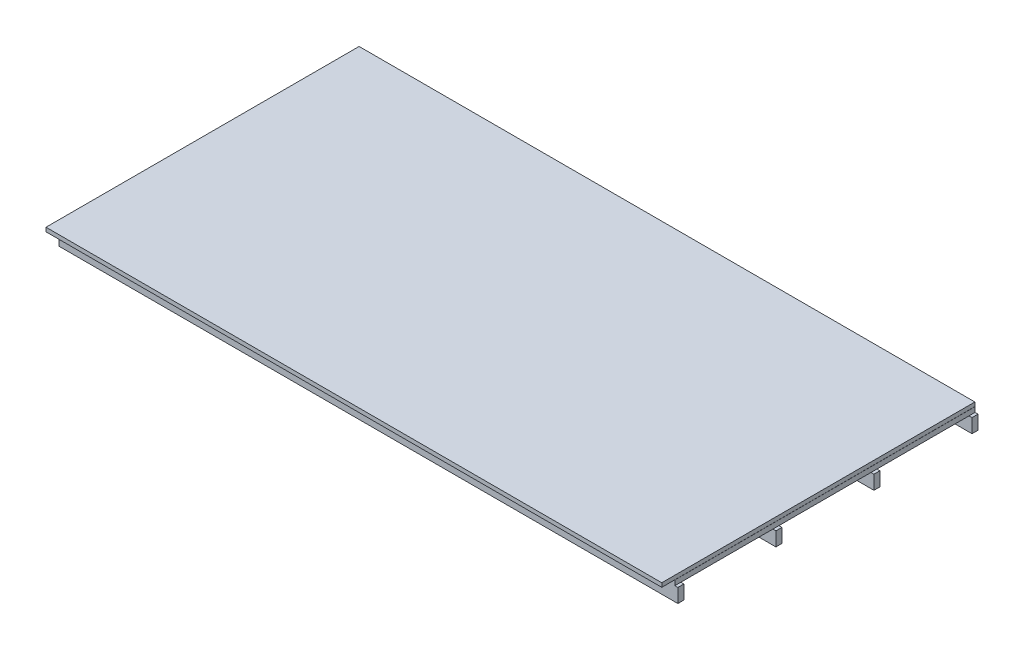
from build123d import *

# Parameters (mm, degrees)
ESQUISSE1_W          = 30
ESQUISSE1_H          = 70
BOSS_EXTRU_1_DEPTH   = 3100
BOSS_EXTRU_1_2_DEPTH = 3100
BOSS_EXTRU_1_3_DEPTH = 3100
BOSS_EXTRU_1_4_DEPTH = 3100
ESQUISSE2_W          = 25
ESQUISSE2_H          = 25
BOSS_EXTRU_2_DEPTH   = 1503.33
ESQUISSE3_W          = 3084.366889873
ESQUISSE3_H          = 1568.292700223
BOSS_EXTRU_3_DEPTH   = 20


with BuildPart() as part:
    # Esquisse1 → Boss.-Extru.1 (new body)
    with BuildSketch(Plane(origin=(0, 0, 0), x_dir=(0, 0, -1), z_dir=(1, 0, 0))):
        with Locations((-245.555, 35)):
            Rectangle(ESQUISSE1_W, ESQUISSE1_H)
    extrude(amount=BOSS_EXTRU_1_DEPTH)



with BuildPart() as body_2:
    # Esquisse1 → Boss.-Extru.1 2 (new body)
    with BuildSketch(Plane(origin=(0, 0, 0), x_dir=(0, 0, -1), z_dir=(1, 0, 0))):
        with Locations((-736.665, 35)):
            Rectangle(ESQUISSE1_W, ESQUISSE1_H)
    extrude(amount=BOSS_EXTRU_1_2_DEPTH)


with BuildPart() as body_3:
    # Esquisse1 → Boss.-Extru.1 3 (new body)
    with BuildSketch(Plane(origin=(0, 0, 0), x_dir=(0, 0, -1), z_dir=(1, 0, 0))):
        with Locations((245.555, 35)):
            Rectangle(ESQUISSE1_W, ESQUISSE1_H)
    extrude(amount=BOSS_EXTRU_1_3_DEPTH)


with BuildPart() as body_4:
    # Esquisse1 → Boss.-Extru.1 4 (new body)
    with BuildSketch(Plane(origin=(0, 0, 0), x_dir=(0, 0, -1), z_dir=(1, 0, 0))):
        with Locations((736.665, 35)):
            Rectangle(ESQUISSE1_W, ESQUISSE1_H)
    extrude(amount=BOSS_EXTRU_1_4_DEPTH)


with BuildPart() as part_1:
    add(part.part)

    add(body_2.part)  # Boss.-Extru.2 merges body 2

    add(body_3.part)  # Boss.-Extru.2 merges body 3

    add(body_4.part)  # Boss.-Extru.2 merges body 4
    # Esquisse2 → Boss.-Extru.2 (add)
    with BuildSketch(Plane.XY.offset(751.665)):
        with Locations((522.5, 82.5)):
            Rectangle(ESQUISSE2_W, ESQUISSE2_H)
        with Locations((12.5, 82.5)):
            Rectangle(ESQUISSE2_W, ESQUISSE2_H)
        with Locations((1032.5, 82.5)):
            Rectangle(ESQUISSE2_W, ESQUISSE2_H)
        with Locations((1542.5, 82.5)):
            Rectangle(ESQUISSE2_W, ESQUISSE2_H)
        with Locations((2052.5, 82.5)):
            Rectangle(ESQUISSE2_W, ESQUISSE2_H)
        with Locations((2562.5, 82.5)):
            Rectangle(ESQUISSE2_W, ESQUISSE2_H)
        with Locations((3072.5, 82.5)):
            Rectangle(ESQUISSE2_W, ESQUISSE2_H)
    extrude(amount=-BOSS_EXTRU_2_DEPTH)

    # Esquisse3 → Boss.-Extru.3 (add)
    with BuildSketch(Plane(origin=(0, 95, 0), x_dir=(1, 0, 0), z_dir=(0, 1, 0))):
        with Locations((1542.183444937, -32.481350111)):
            Rectangle(ESQUISSE3_W, ESQUISSE3_H)
    extrude(amount=BOSS_EXTRU_3_DEPTH)


solid = part_1.part
